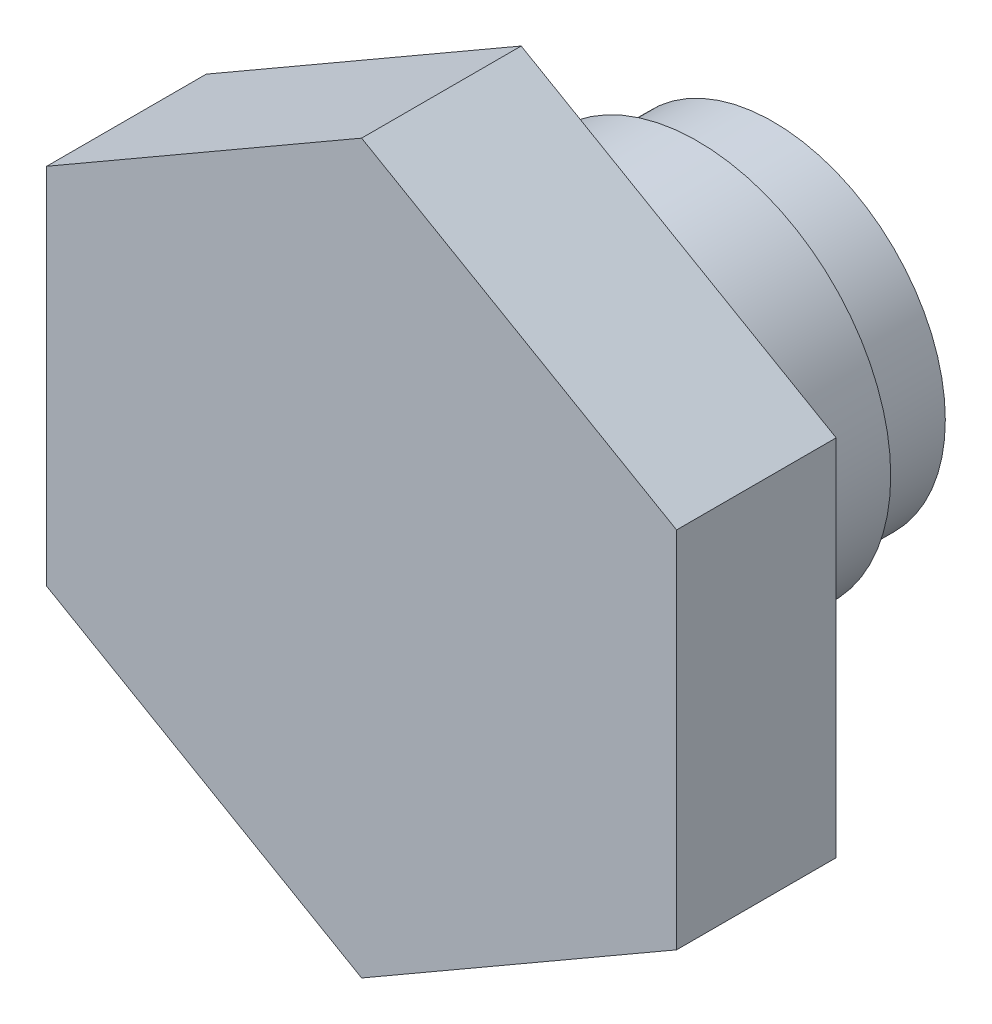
from build123d import *

# Parameters (mm, degrees)
SKETCH1_R         = 5.207
BASE_DEPTH        = 2.286
SKETCH2_R         = 5.842
THREADS_DEPTH     = 5.334
HEX_2_DEPTH       = 4.826
SKETCH4_R         = 2.921
DOME_LAND_DEPTH   = 0.254
DOME1_FACE_RADIUS = 2.921
DOME1_HEIGHT      = 2.54


with BuildPart() as part:
    # Sketch1 → base (new body)
    with BuildSketch(Plane.XY):
        Circle(SKETCH1_R)
    extrude(amount=BASE_DEPTH)

    # Sketch2 → threads (add)
    with BuildSketch(Plane.XY.offset(2.286)):
        Circle(SKETCH2_R)
    extrude(amount=THREADS_DEPTH)

    # Sketch3 → hex 2 (add)
    with BuildSketch(Plane.XY.offset(7.62)):
        Polygon((0, -10.998522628), (9.525, -5.499261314), (9.525, 5.499261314), (0, 10.998522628), (-9.525, 5.499261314), (-9.525, -5.499261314), align=None)
    extrude(amount=HEX_2_DEPTH)

    # Sketch4 → dome_land (add)
    with BuildSketch(Plane(origin=(0, 0, 0), x_dir=(-1, 0, 0), z_dir=(0, 0, -1))):
        with Locations(Location((0, 0, 0), (0, 0, 180))):
            Circle(SKETCH4_R)
    extrude(amount=DOME_LAND_DEPTH)

    # Dome1: a dome of height H over a round flat face of radius A is a cap of a sphere of radius (A * A + H * H) / (2 * H)
    dome1_r = (DOME1_FACE_RADIUS * DOME1_FACE_RADIUS + DOME1_HEIGHT * DOME1_HEIGHT) / (2 * DOME1_HEIGHT)
    dome1_base = Plane((0, 0, -0.254), z_dir=(0, 0, -1))
    with Locations(dome1_base.offset(DOME1_HEIGHT - dome1_r)):
        dome1_ball = Sphere(dome1_r, mode=Mode.PRIVATE)
    add(split(dome1_ball, bisect_by=dome1_base, keep=Keep.TOP, mode=Mode.PRIVATE))


solid = part.part
